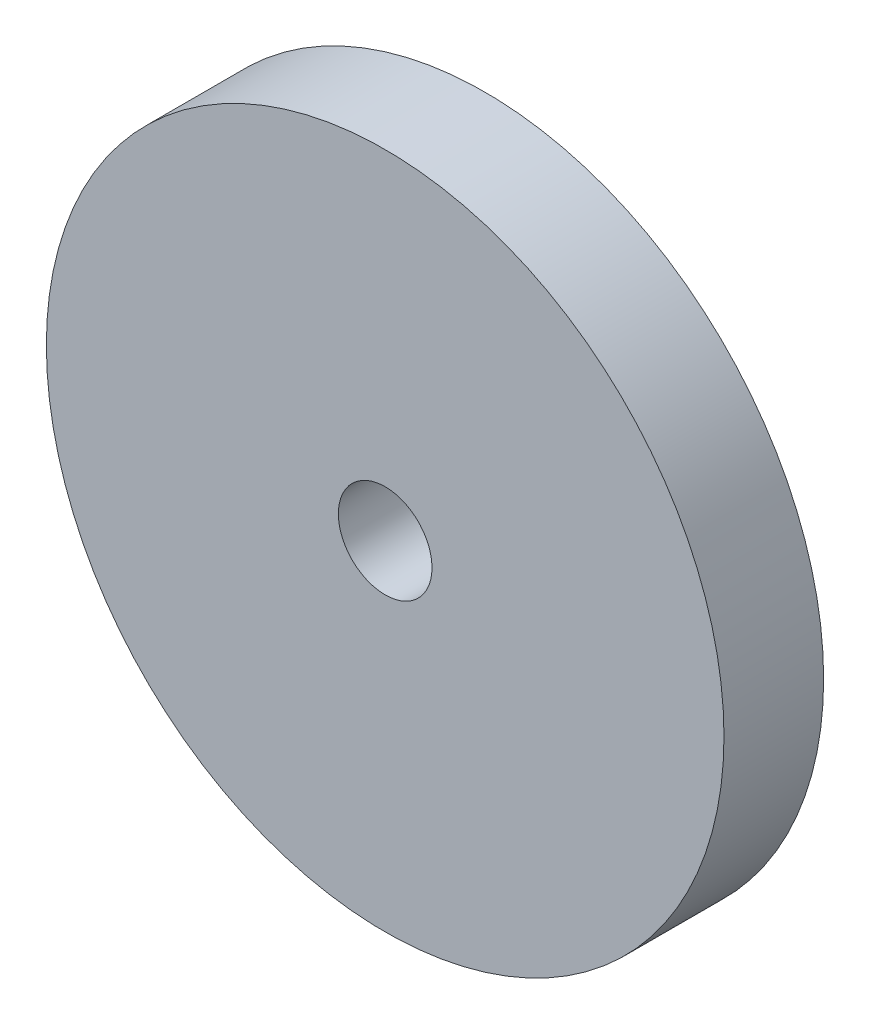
ISO-10303-21;
HEADER;
FILE_DESCRIPTION(('STEP AP214'),'2;1');
FILE_NAME('part.step','',(''),(''),'','','');
FILE_SCHEMA(('AUTOMOTIVE_DESIGN { 1 0 10303 214 1 1 1 1 }'));
ENDSEC;
DATA;
#1=APPLICATION_CONTEXT('core data for automotive mechanical design processes');
#2=APPLICATION_PROTOCOL_DEFINITION('international standard','automotive_design',2000,#1);
#3=PRODUCT_CONTEXT('',#1,'mechanical');
#4=PRODUCT('Part','Part','',(#3));
#5=PRODUCT_RELATED_PRODUCT_CATEGORY('part','',(#4));
#6=PRODUCT_DEFINITION_FORMATION('','',#4);
#7=PRODUCT_DEFINITION_CONTEXT('part definition',#1,'design');
#8=PRODUCT_DEFINITION('design','',#6,#7);
#9=PRODUCT_DEFINITION_SHAPE('','',#8);
#10=(LENGTH_UNIT() NAMED_UNIT(*) SI_UNIT(.MILLI.,.METRE.));
#11=(NAMED_UNIT(*) PLANE_ANGLE_UNIT() SI_UNIT($,.RADIAN.));
#12=(NAMED_UNIT(*) SI_UNIT($,.STERADIAN.) SOLID_ANGLE_UNIT());
#13=UNCERTAINTY_MEASURE_WITH_UNIT(LENGTH_MEASURE(1.E-05),#10,'distance_accuracy_value','');
#14=(GEOMETRIC_REPRESENTATION_CONTEXT(3) GLOBAL_UNCERTAINTY_ASSIGNED_CONTEXT((#13)) GLOBAL_UNIT_ASSIGNED_CONTEXT((#10,
#11,#12)) REPRESENTATION_CONTEXT('',''));
#15=CARTESIAN_POINT('',(0.,0.,0.));
#16=DIRECTION('',(0.,0.,1.));
#17=DIRECTION('',(1.,0.,0.));
#18=AXIS2_PLACEMENT_3D('',#15,#16,#17);
#19=CARTESIAN_POINT('',(0.,0.,2.5));
#20=DIRECTION('',(0.,0.,1.));
#21=DIRECTION('',(1.,0.,0.));
#22=AXIS2_PLACEMENT_3D('',#19,#20,#21);
#23=PLANE('',#22);
#24=CARTESIAN_POINT('',(0.,0.,2.5));
#25=DIRECTION('',(0.,0.,1.));
#26=DIRECTION('',(1.,0.,0.));
#27=AXIS2_PLACEMENT_3D('',#24,#25,#26);
#28=CIRCLE('',#27,17.);
#29=CARTESIAN_POINT('',(17.,0.,2.5));
#30=VERTEX_POINT('',#29);
#31=EDGE_CURVE('E10',#30,#30,#28,.T.);
#32=ORIENTED_EDGE('',*,*,#31,.T.);
#33=EDGE_LOOP('',(#32));
#34=FACE_BOUND('',#33,.T.);
#35=CARTESIAN_POINT('',(0.,0.,2.5));
#36=DIRECTION('',(0.,0.,1.));
#37=DIRECTION('',(1.,0.,0.));
#38=AXIS2_PLACEMENT_3D('',#35,#36,#37);
#39=CIRCLE('',#38,2.35);
#40=CARTESIAN_POINT('',(2.35,0.,2.5));
#41=VERTEX_POINT('',#40);
#42=EDGE_CURVE('E43',#41,#41,#39,.T.);
#43=ORIENTED_EDGE('',*,*,#42,.F.);
#44=EDGE_LOOP('',(#43));
#45=FACE_BOUND('',#44,.T.);
#46=ADVANCED_FACE('F32',(#34,#45),#23,.T.);
#47=CARTESIAN_POINT('',(0.,0.,-2.5));
#48=DIRECTION('',(0.,0.,1.));
#49=DIRECTION('',(1.,0.,0.));
#50=AXIS2_PLACEMENT_3D('',#47,#48,#49);
#51=PLANE('',#50);
#52=CARTESIAN_POINT('',(0.,0.,-2.5));
#53=DIRECTION('',(0.,0.,1.));
#54=DIRECTION('',(1.,0.,0.));
#55=AXIS2_PLACEMENT_3D('',#52,#53,#54);
#56=CIRCLE('',#55,17.);
#57=CARTESIAN_POINT('',(17.,0.,-2.5));
#58=VERTEX_POINT('',#57);
#59=EDGE_CURVE('E36',#58,#58,#56,.T.);
#60=ORIENTED_EDGE('',*,*,#59,.F.);
#61=EDGE_LOOP('',(#60));
#62=FACE_BOUND('',#61,.T.);
#63=CARTESIAN_POINT('',(0.,0.,-2.5));
#64=DIRECTION('',(0.,0.,1.));
#65=DIRECTION('',(1.,0.,0.));
#66=AXIS2_PLACEMENT_3D('',#63,#64,#65);
#67=CIRCLE('',#66,2.35);
#68=CARTESIAN_POINT('',(2.35,0.,-2.5));
#69=VERTEX_POINT('',#68);
#70=EDGE_CURVE('E45',#69,#69,#67,.T.);
#71=ORIENTED_EDGE('',*,*,#70,.T.);
#72=EDGE_LOOP('',(#71));
#73=FACE_BOUND('',#72,.T.);
#74=ADVANCED_FACE('F55',(#62,#73),#51,.F.);
#75=CARTESIAN_POINT('',(0.,0.,2.5));
#76=DIRECTION('',(0.,0.,-1.));
#77=DIRECTION('',(-1.,0.,0.));
#78=AXIS2_PLACEMENT_3D('',#75,#76,#77);
#79=CYLINDRICAL_SURFACE('',#78,17.);
#80=ORIENTED_EDGE('',*,*,#31,.F.);
#81=EDGE_LOOP('',(#80));
#82=FACE_BOUND('',#81,.T.);
#83=ORIENTED_EDGE('',*,*,#59,.T.);
#84=EDGE_LOOP('',(#83));
#85=FACE_BOUND('',#84,.T.);
#86=ADVANCED_FACE('F34',(#82,#85),#79,.T.);
#87=CARTESIAN_POINT('',(0.,0.,2.5));
#88=DIRECTION('',(0.,0.,-1.));
#89=DIRECTION('',(-1.,0.,0.));
#90=AXIS2_PLACEMENT_3D('',#87,#88,#89);
#91=CYLINDRICAL_SURFACE('',#90,2.35);
#92=ORIENTED_EDGE('',*,*,#42,.T.);
#93=EDGE_LOOP('',(#92));
#94=FACE_BOUND('',#93,.T.);
#95=ORIENTED_EDGE('',*,*,#70,.F.);
#96=EDGE_LOOP('',(#95));
#97=FACE_BOUND('',#96,.T.);
#98=ADVANCED_FACE('F51',(#94,#97),#91,.F.);
#99=CLOSED_SHELL('',(#46,#74,#86,#98));
#100=MANIFOLD_SOLID_BREP('B2',#99);
#101=ADVANCED_BREP_SHAPE_REPRESENTATION('',(#18,#100),#14);
#102=SHAPE_DEFINITION_REPRESENTATION(#9,#101);
ENDSEC;
END-ISO-10303-21;
